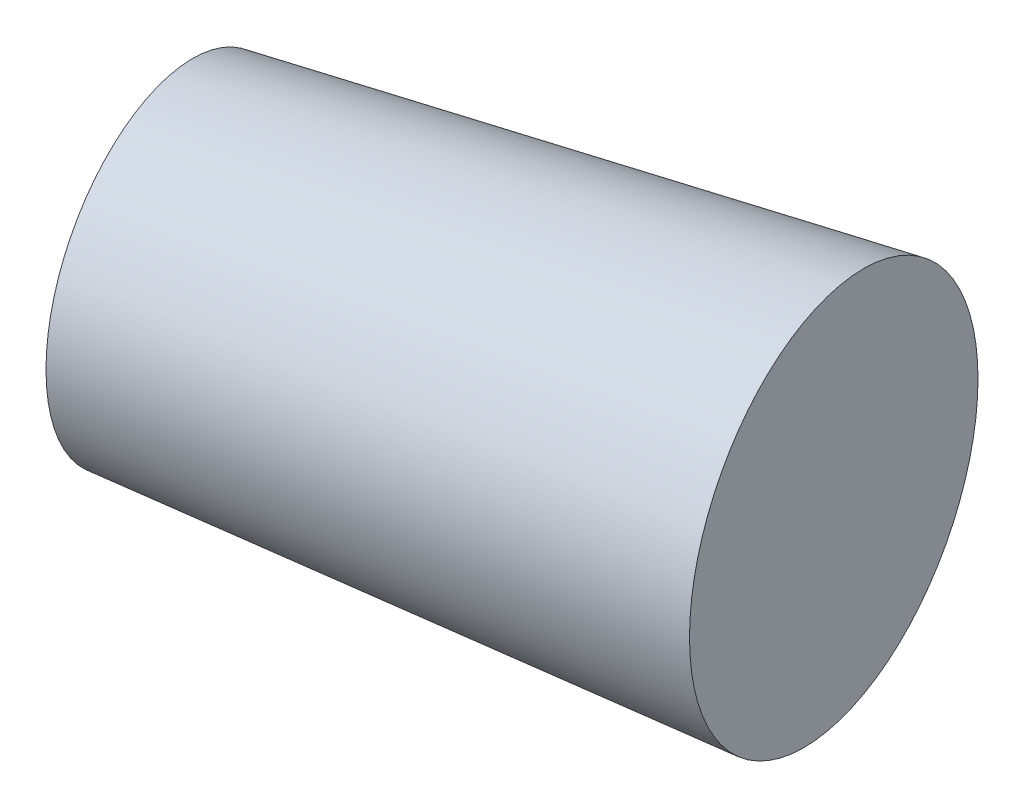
ISO-10303-21;
HEADER;
FILE_DESCRIPTION(('STEP AP214'),'2;1');
FILE_NAME('part.step','',(''),(''),'','','');
FILE_SCHEMA(('AUTOMOTIVE_DESIGN { 1 0 10303 214 1 1 1 1 }'));
ENDSEC;
DATA;
#1=APPLICATION_CONTEXT('core data for automotive mechanical design processes');
#2=APPLICATION_PROTOCOL_DEFINITION('international standard','automotive_design',2000,#1);
#3=PRODUCT_CONTEXT('',#1,'mechanical');
#4=PRODUCT('Part','Part','',(#3));
#5=PRODUCT_RELATED_PRODUCT_CATEGORY('part','',(#4));
#6=PRODUCT_DEFINITION_FORMATION('','',#4);
#7=PRODUCT_DEFINITION_CONTEXT('part definition',#1,'design');
#8=PRODUCT_DEFINITION('design','',#6,#7);
#9=PRODUCT_DEFINITION_SHAPE('','',#8);
#10=(LENGTH_UNIT() NAMED_UNIT(*) SI_UNIT(.MILLI.,.METRE.));
#11=(NAMED_UNIT(*) PLANE_ANGLE_UNIT() SI_UNIT($,.RADIAN.));
#12=(NAMED_UNIT(*) SI_UNIT($,.STERADIAN.) SOLID_ANGLE_UNIT());
#13=UNCERTAINTY_MEASURE_WITH_UNIT(LENGTH_MEASURE(1.E-05),#10,'distance_accuracy_value','');
#14=(GEOMETRIC_REPRESENTATION_CONTEXT(3) GLOBAL_UNCERTAINTY_ASSIGNED_CONTEXT((#13)) GLOBAL_UNIT_ASSIGNED_CONTEXT((#10,
#11,#12)) REPRESENTATION_CONTEXT('',''));
#15=CARTESIAN_POINT('',(0.,0.,0.));
#16=DIRECTION('',(0.,0.,1.));
#17=DIRECTION('',(1.,0.,0.));
#18=AXIS2_PLACEMENT_3D('',#15,#16,#17);
#19=CARTESIAN_POINT('',(3.66111623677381,0.,-0.792331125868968));
#20=DIRECTION('',(0.977373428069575,0.,-0.211521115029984));
#21=DIRECTION('',(-0.211521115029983,0.,-0.977373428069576));
#22=AXIS2_PLACEMENT_3D('',#19,#20,#21);
#23=CONICAL_SURFACE('',#22,3.375,0.0523598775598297);
#24=CARTESIAN_POINT('',(-6.14996084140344,0.,1.33096167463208));
#25=DIRECTION('',(-0.977373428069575,0.,0.211521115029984));
#26=DIRECTION('',(0.211521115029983,0.,0.977373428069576));
#27=AXIS2_PLACEMENT_3D('',#24,#25,#26);
#28=CIRCLE('',#27,2.84891984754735);
#29=CARTESIAN_POINT('',(-5.54735413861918,0.,4.11542023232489));
#30=VERTEX_POINT('',#29);
#31=EDGE_CURVE('E10',#30,#30,#28,.T.);
#32=ORIENTED_EDGE('',*,*,#31,.F.);
#33=EDGE_LOOP('',(#32));
#34=FACE_BOUND('',#33,.T.);
#35=CARTESIAN_POINT('',(3.66111623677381,0.,-0.792331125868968));
#36=DIRECTION('',(-0.977373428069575,0.,0.211521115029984));
#37=DIRECTION('',(0.211521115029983,0.,0.977373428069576));
#38=AXIS2_PLACEMENT_3D('',#35,#36,#37);
#39=CIRCLE('',#38,3.375);
#40=CARTESIAN_POINT('',(4.37500000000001,0.,2.50630419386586));
#41=VERTEX_POINT('',#40);
#42=EDGE_CURVE('E35',#41,#41,#39,.T.);
#43=ORIENTED_EDGE('',*,*,#42,.T.);
#44=EDGE_LOOP('',(#43));
#45=FACE_BOUND('',#44,.T.);
#46=ADVANCED_FACE('F29',(#34,#45),#23,.T.);
#47=CARTESIAN_POINT('',(-6.14996084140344,0.,1.33096167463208));
#48=DIRECTION('',(0.977373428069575,0.,-0.211521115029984));
#49=DIRECTION('',(-0.211521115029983,0.,-0.977373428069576));
#50=AXIS2_PLACEMENT_3D('',#47,#48,#49);
#51=PLANE('',#50);
#52=ORIENTED_EDGE('',*,*,#31,.T.);
#53=EDGE_LOOP('',(#52));
#54=FACE_BOUND('',#53,.T.);
#55=ADVANCED_FACE('F44',(#54),#51,.F.);
#56=CARTESIAN_POINT('',(3.66111623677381,0.,-0.792331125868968));
#57=DIRECTION('',(-0.977373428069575,0.,0.211521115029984));
#58=DIRECTION('',(0.211521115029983,0.,0.977373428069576));
#59=AXIS2_PLACEMENT_3D('',#56,#57,#58);
#60=PLANE('',#59);
#61=ORIENTED_EDGE('',*,*,#42,.F.);
#62=EDGE_LOOP('',(#61));
#63=FACE_BOUND('',#62,.T.);
#64=ADVANCED_FACE('F42',(#63),#60,.F.);
#65=CLOSED_SHELL('',(#46,#55,#64));
#66=MANIFOLD_SOLID_BREP('B2',#65);
#67=ADVANCED_BREP_SHAPE_REPRESENTATION('',(#18,#66),#14);
#68=SHAPE_DEFINITION_REPRESENTATION(#9,#67);
ENDSEC;
END-ISO-10303-21;
